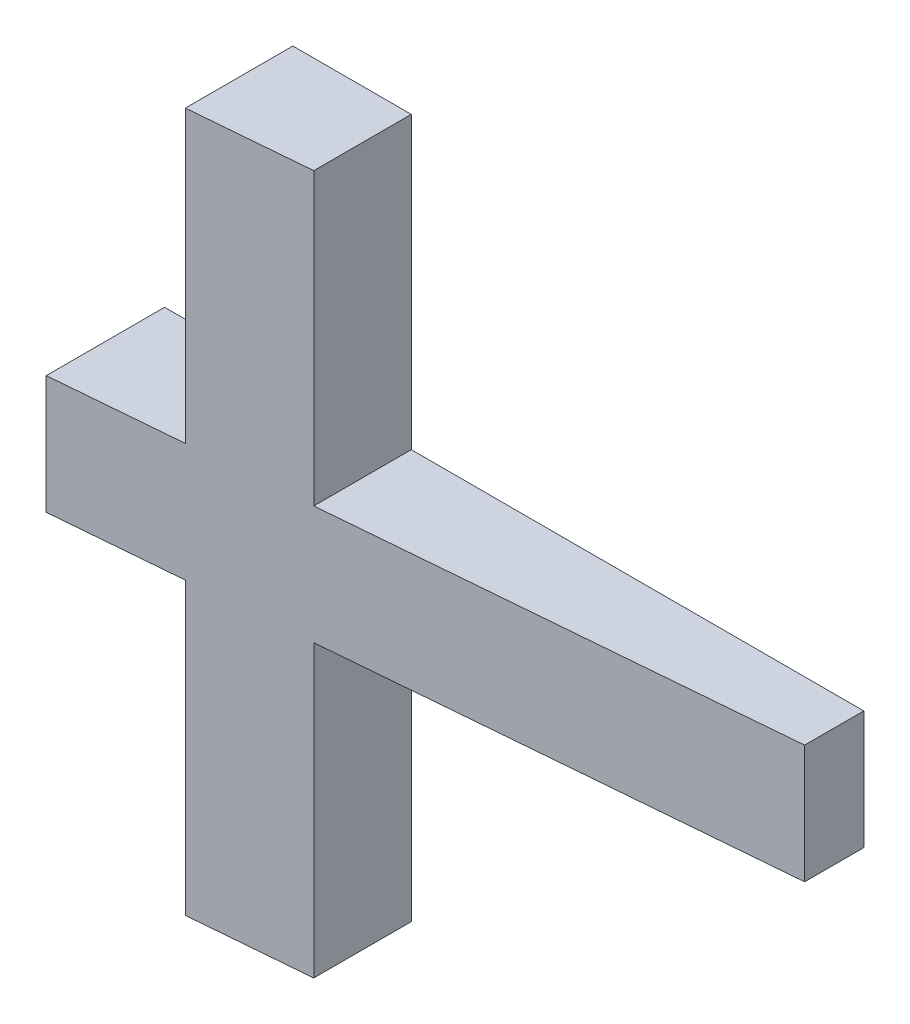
ISO-10303-21;
HEADER;
FILE_DESCRIPTION(('STEP AP214'),'2;1');
FILE_NAME('part.step','',(''),(''),'','','');
FILE_SCHEMA(('AUTOMOTIVE_DESIGN { 1 0 10303 214 1 1 1 1 }'));
ENDSEC;
DATA;
#1=APPLICATION_CONTEXT('core data for automotive mechanical design processes');
#2=APPLICATION_PROTOCOL_DEFINITION('international standard','automotive_design',2000,#1);
#3=PRODUCT_CONTEXT('',#1,'mechanical');
#4=PRODUCT('Part','Part','',(#3));
#5=PRODUCT_RELATED_PRODUCT_CATEGORY('part','',(#4));
#6=PRODUCT_DEFINITION_FORMATION('','',#4);
#7=PRODUCT_DEFINITION_CONTEXT('part definition',#1,'design');
#8=PRODUCT_DEFINITION('design','',#6,#7);
#9=PRODUCT_DEFINITION_SHAPE('','',#8);
#10=(LENGTH_UNIT() NAMED_UNIT(*) SI_UNIT(.MILLI.,.METRE.));
#11=(NAMED_UNIT(*) PLANE_ANGLE_UNIT() SI_UNIT($,.RADIAN.));
#12=(NAMED_UNIT(*) SI_UNIT($,.STERADIAN.) SOLID_ANGLE_UNIT());
#13=UNCERTAINTY_MEASURE_WITH_UNIT(LENGTH_MEASURE(1.E-05),#10,'distance_accuracy_value','');
#14=(GEOMETRIC_REPRESENTATION_CONTEXT(3) GLOBAL_UNCERTAINTY_ASSIGNED_CONTEXT((#13)) GLOBAL_UNIT_ASSIGNED_CONTEXT((#10,
#11,#12)) REPRESENTATION_CONTEXT('',''));
#15=CARTESIAN_POINT('',(0.,0.,0.));
#16=DIRECTION('',(0.,0.,1.));
#17=DIRECTION('',(1.,0.,0.));
#18=AXIS2_PLACEMENT_3D('',#15,#16,#17);
#19=CARTESIAN_POINT('',(-304.8,-304.8,609.6));
#20=DIRECTION('',(0.,1.,0.));
#21=DIRECTION('',(-1.,0.,0.));
#22=AXIS2_PLACEMENT_3D('',#19,#20,#21);
#23=PLANE('',#22);
#24=DIRECTION('',(0.,0.,-1.));
#25=VECTOR('',#24,1.);
#26=CARTESIAN_POINT('',(-304.8,-304.8,609.6));
#27=LINE('',#26,#25);
#28=CARTESIAN_POINT('',(-304.8,-304.8,553.686133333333));
#29=VERTEX_POINT('',#28);
#30=CARTESIAN_POINT('',(-304.8,-304.8,0.));
#31=VERTEX_POINT('',#30);
#32=EDGE_CURVE('E11',#29,#31,#27,.T.);
#33=ORIENTED_EDGE('',*,*,#32,.F.);
#34=DIRECTION('',(-0.99643493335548,0.,0.0843648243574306));
#35=VECTOR('',#34,1.);
#36=CARTESIAN_POINT('',(-309.500346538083,-304.8,554.084096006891));
#37=LINE('',#36,#35);
#38=CARTESIAN_POINT('',(-965.200000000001,-304.8,609.6));
#39=VERTEX_POINT('',#38);
#40=EDGE_CURVE('E245',#29,#39,#37,.T.);
#41=ORIENTED_EDGE('',*,*,#40,.T.);
#42=DIRECTION('',(0.,0.,-1.));
#43=VECTOR('',#42,1.);
#44=CARTESIAN_POINT('',(-965.200000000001,-304.8,609.6));
#45=LINE('',#44,#43);
#46=CARTESIAN_POINT('',(-965.200000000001,-304.8,0.));
#47=VERTEX_POINT('',#46);
#48=EDGE_CURVE('E116',#39,#47,#45,.T.);
#49=ORIENTED_EDGE('',*,*,#48,.T.);
#50=DIRECTION('',(1.,0.,0.));
#51=VECTOR('',#50,1.);
#52=CARTESIAN_POINT('',(-304.8,-304.8,0.));
#53=LINE('',#52,#51);
#54=EDGE_CURVE('E122',#47,#31,#53,.T.);
#55=ORIENTED_EDGE('',*,*,#54,.T.);
#56=EDGE_LOOP('',(#33,#41,#49,#55));
#57=FACE_BOUND('',#56,.T.);
#58=ADVANCED_FACE('F43',(#57),#23,.F.);
#59=CARTESIAN_POINT('',(-304.8,-1800.,609.6));
#60=DIRECTION('',(1.,0.,0.));
#61=DIRECTION('',(0.,1.,0.));
#62=AXIS2_PLACEMENT_3D('',#59,#60,#61);
#63=PLANE('',#62);
#64=DIRECTION('',(0.,0.,-1.));
#65=VECTOR('',#64,1.);
#66=CARTESIAN_POINT('',(-304.8,-1800.,609.6));
#67=LINE('',#66,#65);
#68=CARTESIAN_POINT('',(-304.8,-1800.,553.686133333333));
#69=VERTEX_POINT('',#68);
#70=CARTESIAN_POINT('',(-304.8,-1800.,0.));
#71=VERTEX_POINT('',#70);
#72=EDGE_CURVE('E51',#69,#71,#67,.T.);
#73=ORIENTED_EDGE('',*,*,#72,.F.);
#74=DIRECTION('',(0.,1.,0.));
#75=VECTOR('',#74,1.);
#76=CARTESIAN_POINT('',(-304.8,-1800.,553.686133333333));
#77=LINE('',#76,#75);
#78=EDGE_CURVE('E247',#69,#29,#77,.T.);
#79=ORIENTED_EDGE('',*,*,#78,.T.);
#80=ORIENTED_EDGE('',*,*,#32,.T.);
#81=DIRECTION('',(0.,-1.,0.));
#82=VECTOR('',#81,1.);
#83=CARTESIAN_POINT('',(-304.8,-1800.,0.));
#84=LINE('',#83,#82);
#85=EDGE_CURVE('E157',#31,#71,#84,.T.);
#86=ORIENTED_EDGE('',*,*,#85,.T.);
#87=EDGE_LOOP('',(#73,#79,#80,#86));
#88=FACE_BOUND('',#87,.T.);
#89=ADVANCED_FACE('F158',(#88),#63,.F.);
#90=CARTESIAN_POINT('',(304.8,-1800.,609.6));
#91=DIRECTION('',(0.,1.,0.));
#92=DIRECTION('',(0.,0.,1.));
#93=AXIS2_PLACEMENT_3D('',#90,#91,#92);
#94=PLANE('',#93);
#95=DIRECTION('',(0.,0.,-1.));
#96=VECTOR('',#95,1.);
#97=CARTESIAN_POINT('',(304.8,-1800.,609.6));
#98=LINE('',#97,#96);
#99=CARTESIAN_POINT('',(304.8,-1800.,502.073333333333));
#100=VERTEX_POINT('',#99);
#101=CARTESIAN_POINT('',(304.8,-1800.,0.));
#102=VERTEX_POINT('',#101);
#103=EDGE_CURVE('E141',#100,#102,#98,.T.);
#104=ORIENTED_EDGE('',*,*,#103,.F.);
#105=DIRECTION('',(-0.99643493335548,0.,0.0843648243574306));
#106=VECTOR('',#105,1.);
#107=CARTESIAN_POINT('',(-965.200000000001,-1800.,609.6));
#108=LINE('',#107,#106);
#109=EDGE_CURVE('E154',#100,#69,#108,.T.);
#110=ORIENTED_EDGE('',*,*,#109,.T.);
#111=ORIENTED_EDGE('',*,*,#72,.T.);
#112=DIRECTION('',(1.,0.,0.));
#113=VECTOR('',#112,1.);
#114=CARTESIAN_POINT('',(304.8,-1800.,0.));
#115=LINE('',#114,#113);
#116=EDGE_CURVE('E150',#71,#102,#115,.T.);
#117=ORIENTED_EDGE('',*,*,#116,.T.);
#118=EDGE_LOOP('',(#104,#110,#111,#117));
#119=FACE_BOUND('',#118,.T.);
#120=ADVANCED_FACE('F148',(#119),#94,.F.);
#121=CARTESIAN_POINT('',(304.8,-304.8,609.6));
#122=DIRECTION('',(-1.,0.,0.));
#123=DIRECTION('',(0.,-1.,0.));
#124=AXIS2_PLACEMENT_3D('',#121,#122,#123);
#125=PLANE('',#124);
#126=DIRECTION('',(0.,0.,-1.));
#127=VECTOR('',#126,1.);
#128=CARTESIAN_POINT('',(304.8,-304.8,609.6));
#129=LINE('',#128,#127);
#130=CARTESIAN_POINT('',(304.8,-304.8,502.073333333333));
#131=VERTEX_POINT('',#130);
#132=CARTESIAN_POINT('',(304.8,-304.8,0.));
#133=VERTEX_POINT('',#132);
#134=EDGE_CURVE('E139',#131,#133,#129,.T.);
#135=ORIENTED_EDGE('',*,*,#134,.F.);
#136=DIRECTION('',(0.,-1.,0.));
#137=VECTOR('',#136,1.);
#138=CARTESIAN_POINT('',(304.8,-304.8,502.073333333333));
#139=LINE('',#138,#137);
#140=EDGE_CURVE('E230',#131,#100,#139,.T.);
#141=ORIENTED_EDGE('',*,*,#140,.T.);
#142=ORIENTED_EDGE('',*,*,#103,.T.);
#143=DIRECTION('',(0.,1.,0.));
#144=VECTOR('',#143,1.);
#145=CARTESIAN_POINT('',(304.8,-304.8,0.));
#146=LINE('',#145,#144);
#147=EDGE_CURVE('E163',#102,#133,#146,.T.);
#148=ORIENTED_EDGE('',*,*,#147,.T.);
#149=EDGE_LOOP('',(#135,#141,#142,#148));
#150=FACE_BOUND('',#149,.T.);
#151=ADVANCED_FACE('F227',(#150),#125,.F.);
#152=CARTESIAN_POINT('',(2634.8,-304.8,609.6));
#153=DIRECTION('',(0.,1.,0.));
#154=DIRECTION('',(-1.,0.,0.));
#155=AXIS2_PLACEMENT_3D('',#152,#153,#154);
#156=PLANE('',#155);
#157=DIRECTION('',(0.,0.,-1.));
#158=VECTOR('',#157,1.);
#159=CARTESIAN_POINT('',(2634.8,-304.8,609.6));
#160=LINE('',#159,#158);
#161=CARTESIAN_POINT('',(2634.8,-304.8,304.8));
#162=VERTEX_POINT('',#161);
#163=CARTESIAN_POINT('',(2634.8,-304.8,0.));
#164=VERTEX_POINT('',#163);
#165=EDGE_CURVE('E137',#162,#164,#160,.T.);
#166=ORIENTED_EDGE('',*,*,#165,.F.);
#167=DIRECTION('',(-0.99643493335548,0.,0.0843648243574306));
#168=VECTOR('',#167,1.);
#169=CARTESIAN_POINT('',(2609.1772750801,-304.8,306.969390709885));
#170=LINE('',#169,#168);
#171=EDGE_CURVE('E224',#162,#131,#170,.T.);
#172=ORIENTED_EDGE('',*,*,#171,.T.);
#173=ORIENTED_EDGE('',*,*,#134,.T.);
#174=DIRECTION('',(1.,0.,0.));
#175=VECTOR('',#174,1.);
#176=CARTESIAN_POINT('',(2634.8,-304.8,0.));
#177=LINE('',#176,#175);
#178=EDGE_CURVE('E165',#133,#164,#177,.T.);
#179=ORIENTED_EDGE('',*,*,#178,.T.);
#180=EDGE_LOOP('',(#166,#172,#173,#179));
#181=FACE_BOUND('',#180,.T.);
#182=ADVANCED_FACE('F220',(#181),#156,.F.);
#183=CARTESIAN_POINT('',(2634.8,304.8,609.6));
#184=DIRECTION('',(-1.,0.,0.));
#185=DIRECTION('',(0.,0.,1.));
#186=AXIS2_PLACEMENT_3D('',#183,#184,#185);
#187=PLANE('',#186);
#188=DIRECTION('',(0.,0.,-1.));
#189=VECTOR('',#188,1.);
#190=CARTESIAN_POINT('',(2634.8,304.8,609.6));
#191=LINE('',#190,#189);
#192=CARTESIAN_POINT('',(2634.8,304.8,304.8));
#193=VERTEX_POINT('',#192);
#194=CARTESIAN_POINT('',(2634.8,304.8,0.));
#195=VERTEX_POINT('',#194);
#196=EDGE_CURVE('E135',#193,#195,#191,.T.);
#197=ORIENTED_EDGE('',*,*,#196,.F.);
#198=DIRECTION('',(0.,1.,0.));
#199=VECTOR('',#198,1.);
#200=CARTESIAN_POINT('',(2634.8,-1800.,304.8));
#201=LINE('',#200,#199);
#202=EDGE_CURVE('E217',#162,#193,#201,.T.);
#203=ORIENTED_EDGE('',*,*,#202,.F.);
#204=ORIENTED_EDGE('',*,*,#165,.T.);
#205=DIRECTION('',(0.,1.,0.));
#206=VECTOR('',#205,1.);
#207=CARTESIAN_POINT('',(2634.8,304.8,0.));
#208=LINE('',#207,#206);
#209=EDGE_CURVE('E171',#164,#195,#208,.T.);
#210=ORIENTED_EDGE('',*,*,#209,.T.);
#211=EDGE_LOOP('',(#197,#203,#204,#210));
#212=FACE_BOUND('',#211,.T.);
#213=ADVANCED_FACE('F211',(#212),#187,.F.);
#214=CARTESIAN_POINT('',(304.8,304.8,609.6));
#215=DIRECTION('',(0.,-1.,0.));
#216=DIRECTION('',(1.,0.,0.));
#217=AXIS2_PLACEMENT_3D('',#214,#215,#216);
#218=PLANE('',#217);
#219=DIRECTION('',(0.,0.,-1.));
#220=VECTOR('',#219,1.);
#221=CARTESIAN_POINT('',(304.8,304.8,609.6));
#222=LINE('',#221,#220);
#223=CARTESIAN_POINT('',(304.8,304.8,502.073333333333));
#224=VERTEX_POINT('',#223);
#225=CARTESIAN_POINT('',(304.8,304.8,0.));
#226=VERTEX_POINT('',#225);
#227=EDGE_CURVE('E133',#224,#226,#222,.T.);
#228=ORIENTED_EDGE('',*,*,#227,.F.);
#229=DIRECTION('',(0.99643493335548,0.,-0.0843648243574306));
#230=VECTOR('',#229,1.);
#231=CARTESIAN_POINT('',(295.760872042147,304.8,502.838646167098));
#232=LINE('',#231,#230);
#233=EDGE_CURVE('E254',#224,#193,#232,.T.);
#234=ORIENTED_EDGE('',*,*,#233,.T.);
#235=ORIENTED_EDGE('',*,*,#196,.T.);
#236=DIRECTION('',(-1.,0.,0.));
#237=VECTOR('',#236,1.);
#238=CARTESIAN_POINT('',(304.8,304.8,0.));
#239=LINE('',#238,#237);
#240=EDGE_CURVE('E174',#195,#226,#239,.T.);
#241=ORIENTED_EDGE('',*,*,#240,.T.);
#242=EDGE_LOOP('',(#228,#234,#235,#241));
#243=FACE_BOUND('',#242,.T.);
#244=ADVANCED_FACE('F207',(#243),#218,.F.);
#245=CARTESIAN_POINT('',(304.8,1800.,609.6));
#246=DIRECTION('',(-1.,0.,0.));
#247=DIRECTION('',(0.,-1.,0.));
#248=AXIS2_PLACEMENT_3D('',#245,#246,#247);
#249=PLANE('',#248);
#250=DIRECTION('',(0.,0.,-1.));
#251=VECTOR('',#250,1.);
#252=CARTESIAN_POINT('',(304.8,1800.,609.6));
#253=LINE('',#252,#251);
#254=CARTESIAN_POINT('',(304.8,1800.,502.073333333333));
#255=VERTEX_POINT('',#254);
#256=CARTESIAN_POINT('',(304.8,1800.,0.));
#257=VERTEX_POINT('',#256);
#258=EDGE_CURVE('E131',#255,#257,#253,.T.);
#259=ORIENTED_EDGE('',*,*,#258,.F.);
#260=DIRECTION('',(0.,-1.,0.));
#261=VECTOR('',#260,1.);
#262=CARTESIAN_POINT('',(304.8,1800.,502.073333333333));
#263=LINE('',#262,#261);
#264=EDGE_CURVE('E204',#255,#224,#263,.T.);
#265=ORIENTED_EDGE('',*,*,#264,.T.);
#266=ORIENTED_EDGE('',*,*,#227,.T.);
#267=DIRECTION('',(0.,1.,0.));
#268=VECTOR('',#267,1.);
#269=CARTESIAN_POINT('',(304.8,1800.,0.));
#270=LINE('',#269,#268);
#271=EDGE_CURVE('E177',#226,#257,#270,.T.);
#272=ORIENTED_EDGE('',*,*,#271,.T.);
#273=EDGE_LOOP('',(#259,#265,#266,#272));
#274=FACE_BOUND('',#273,.T.);
#275=ADVANCED_FACE('F200',(#274),#249,.F.);
#276=CARTESIAN_POINT('',(-304.8,1800.,609.6));
#277=DIRECTION('',(0.,-1.,0.));
#278=DIRECTION('',(0.,0.,-1.));
#279=AXIS2_PLACEMENT_3D('',#276,#277,#278);
#280=PLANE('',#279);
#281=DIRECTION('',(0.,0.,-1.));
#282=VECTOR('',#281,1.);
#283=CARTESIAN_POINT('',(-304.8,1800.,609.6));
#284=LINE('',#283,#282);
#285=CARTESIAN_POINT('',(-304.8,1800.,553.686133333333));
#286=VERTEX_POINT('',#285);
#287=CARTESIAN_POINT('',(-304.8,1800.,0.));
#288=VERTEX_POINT('',#287);
#289=EDGE_CURVE('E129',#286,#288,#284,.T.);
#290=ORIENTED_EDGE('',*,*,#289,.F.);
#291=DIRECTION('',(-0.99643493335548,0.,0.0843648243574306));
#292=VECTOR('',#291,1.);
#293=CARTESIAN_POINT('',(-965.200000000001,1800.,609.6));
#294=LINE('',#293,#292);
#295=EDGE_CURVE('E197',#255,#286,#294,.T.);
#296=ORIENTED_EDGE('',*,*,#295,.F.);
#297=ORIENTED_EDGE('',*,*,#258,.T.);
#298=DIRECTION('',(-1.,0.,0.));
#299=VECTOR('',#298,1.);
#300=CARTESIAN_POINT('',(-304.8,1800.,0.));
#301=LINE('',#300,#299);
#302=EDGE_CURVE('E180',#257,#288,#301,.T.);
#303=ORIENTED_EDGE('',*,*,#302,.T.);
#304=EDGE_LOOP('',(#290,#296,#297,#303));
#305=FACE_BOUND('',#304,.T.);
#306=ADVANCED_FACE('F191',(#305),#280,.F.);
#307=CARTESIAN_POINT('',(-304.8,304.8,609.6));
#308=DIRECTION('',(1.,0.,0.));
#309=DIRECTION('',(0.,1.,0.));
#310=AXIS2_PLACEMENT_3D('',#307,#308,#309);
#311=PLANE('',#310);
#312=DIRECTION('',(0.,0.,-1.));
#313=VECTOR('',#312,1.);
#314=CARTESIAN_POINT('',(-304.8,304.8,609.6));
#315=LINE('',#314,#313);
#316=CARTESIAN_POINT('',(-304.8,304.8,553.686133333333));
#317=VERTEX_POINT('',#316);
#318=CARTESIAN_POINT('',(-304.8,304.8,0.));
#319=VERTEX_POINT('',#318);
#320=EDGE_CURVE('E103',#317,#319,#315,.T.);
#321=ORIENTED_EDGE('',*,*,#320,.F.);
#322=DIRECTION('',(0.,1.,0.));
#323=VECTOR('',#322,1.);
#324=CARTESIAN_POINT('',(-304.8,304.8,553.686133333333));
#325=LINE('',#324,#323);
#326=EDGE_CURVE('E257',#317,#286,#325,.T.);
#327=ORIENTED_EDGE('',*,*,#326,.T.);
#328=ORIENTED_EDGE('',*,*,#289,.T.);
#329=DIRECTION('',(0.,-1.,0.));
#330=VECTOR('',#329,1.);
#331=CARTESIAN_POINT('',(-304.8,304.8,0.));
#332=LINE('',#331,#330);
#333=EDGE_CURVE('E109',#288,#319,#332,.T.);
#334=ORIENTED_EDGE('',*,*,#333,.T.);
#335=EDGE_LOOP('',(#321,#327,#328,#334));
#336=FACE_BOUND('',#335,.T.);
#337=ADVANCED_FACE('F183',(#336),#311,.F.);
#338=CARTESIAN_POINT('',(-965.200000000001,304.8,609.6));
#339=DIRECTION('',(0.,-1.,0.));
#340=DIRECTION('',(1.,0.,0.));
#341=AXIS2_PLACEMENT_3D('',#338,#339,#340);
#342=PLANE('',#341);
#343=DIRECTION('',(0.,0.,-1.));
#344=VECTOR('',#343,1.);
#345=CARTESIAN_POINT('',(-965.200000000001,304.8,609.6));
#346=LINE('',#345,#344);
#347=CARTESIAN_POINT('',(-965.200000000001,304.8,609.6));
#348=VERTEX_POINT('',#347);
#349=CARTESIAN_POINT('',(-965.200000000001,304.8,0.));
#350=VERTEX_POINT('',#349);
#351=EDGE_CURVE('E100',#348,#350,#346,.T.);
#352=ORIENTED_EDGE('',*,*,#351,.F.);
#353=DIRECTION('',(0.99643493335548,0.,-0.0843648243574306));
#354=VECTOR('',#353,1.);
#355=CARTESIAN_POINT('',(-965.200000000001,304.8,609.6));
#356=LINE('',#355,#354);
#357=EDGE_CURVE('E58',#348,#317,#356,.T.);
#358=ORIENTED_EDGE('',*,*,#357,.T.);
#359=ORIENTED_EDGE('',*,*,#320,.T.);
#360=DIRECTION('',(-1.,0.,0.));
#361=VECTOR('',#360,1.);
#362=CARTESIAN_POINT('',(-965.200000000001,304.8,0.));
#363=LINE('',#362,#361);
#364=EDGE_CURVE('E97',#319,#350,#363,.T.);
#365=ORIENTED_EDGE('',*,*,#364,.T.);
#366=EDGE_LOOP('',(#352,#358,#359,#365));
#367=FACE_BOUND('',#366,.T.);
#368=ADVANCED_FACE('F99',(#367),#342,.F.);
#369=CARTESIAN_POINT('',(-965.200000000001,-304.8,609.6));
#370=DIRECTION('',(1.,0.,0.));
#371=DIRECTION('',(0.,1.,0.));
#372=AXIS2_PLACEMENT_3D('',#369,#370,#371);
#373=PLANE('',#372);
#374=DIRECTION('',(0.,-1.,0.));
#375=VECTOR('',#374,1.);
#376=CARTESIAN_POINT('',(-965.200000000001,-304.8,0.));
#377=LINE('',#376,#375);
#378=EDGE_CURVE('E108',#350,#47,#377,.T.);
#379=ORIENTED_EDGE('',*,*,#378,.T.);
#380=ORIENTED_EDGE('',*,*,#48,.F.);
#381=DIRECTION('',(0.,-1.,0.));
#382=VECTOR('',#381,1.);
#383=CARTESIAN_POINT('',(-965.200000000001,-304.8,609.6));
#384=LINE('',#383,#382);
#385=EDGE_CURVE('E115',#348,#39,#384,.T.);
#386=ORIENTED_EDGE('',*,*,#385,.F.);
#387=ORIENTED_EDGE('',*,*,#351,.T.);
#388=EDGE_LOOP('',(#379,#380,#386,#387));
#389=FACE_BOUND('',#388,.T.);
#390=ADVANCED_FACE('F112',(#389),#373,.F.);
#391=CARTESIAN_POINT('',(0.,0.,0.));
#392=DIRECTION('',(0.,0.,-1.));
#393=DIRECTION('',(-1.,0.,0.));
#394=AXIS2_PLACEMENT_3D('',#391,#392,#393);
#395=PLANE('',#394);
#396=ORIENTED_EDGE('',*,*,#54,.F.);
#397=ORIENTED_EDGE('',*,*,#378,.F.);
#398=ORIENTED_EDGE('',*,*,#364,.F.);
#399=ORIENTED_EDGE('',*,*,#333,.F.);
#400=ORIENTED_EDGE('',*,*,#302,.F.);
#401=ORIENTED_EDGE('',*,*,#271,.F.);
#402=ORIENTED_EDGE('',*,*,#240,.F.);
#403=ORIENTED_EDGE('',*,*,#209,.F.);
#404=ORIENTED_EDGE('',*,*,#178,.F.);
#405=ORIENTED_EDGE('',*,*,#147,.F.);
#406=ORIENTED_EDGE('',*,*,#116,.F.);
#407=ORIENTED_EDGE('',*,*,#85,.F.);
#408=EDGE_LOOP('',(#396,#397,#398,#399,#400,#401,#402,#403,#404,#405,#406,#407));
#409=FACE_BOUND('',#408,.T.);
#410=ADVANCED_FACE('F119',(#409),#395,.T.);
#411=CARTESIAN_POINT('',(-965.200000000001,-1800.,609.6));
#412=DIRECTION('',(-0.0843648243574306,0.,-0.99643493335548));
#413=DIRECTION('',(-0.99643493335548,0.,0.0843648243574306));
#414=AXIS2_PLACEMENT_3D('',#411,#412,#413);
#415=PLANE('',#414);
#416=ORIENTED_EDGE('',*,*,#78,.F.);
#417=ORIENTED_EDGE('',*,*,#109,.F.);
#418=ORIENTED_EDGE('',*,*,#140,.F.);
#419=ORIENTED_EDGE('',*,*,#171,.F.);
#420=ORIENTED_EDGE('',*,*,#202,.T.);
#421=ORIENTED_EDGE('',*,*,#233,.F.);
#422=ORIENTED_EDGE('',*,*,#264,.F.);
#423=ORIENTED_EDGE('',*,*,#295,.T.);
#424=ORIENTED_EDGE('',*,*,#326,.F.);
#425=ORIENTED_EDGE('',*,*,#357,.F.);
#426=ORIENTED_EDGE('',*,*,#385,.T.);
#427=ORIENTED_EDGE('',*,*,#40,.F.);
#428=EDGE_LOOP('',(#416,#417,#418,#419,#420,#421,#422,#423,#424,#425,#426,#427));
#429=FACE_BOUND('',#428,.T.);
#430=ADVANCED_FACE('F246',(#429),#415,.F.);
#431=CLOSED_SHELL('',(#58,#89,#120,#151,#182,#213,#244,#275,#306,#337,#368,#390,#410,#430));
#432=MANIFOLD_SOLID_BREP('B2',#431);
#433=ADVANCED_BREP_SHAPE_REPRESENTATION('',(#18,#432),#14);
#434=SHAPE_DEFINITION_REPRESENTATION(#9,#433);
ENDSEC;
END-ISO-10303-21;
